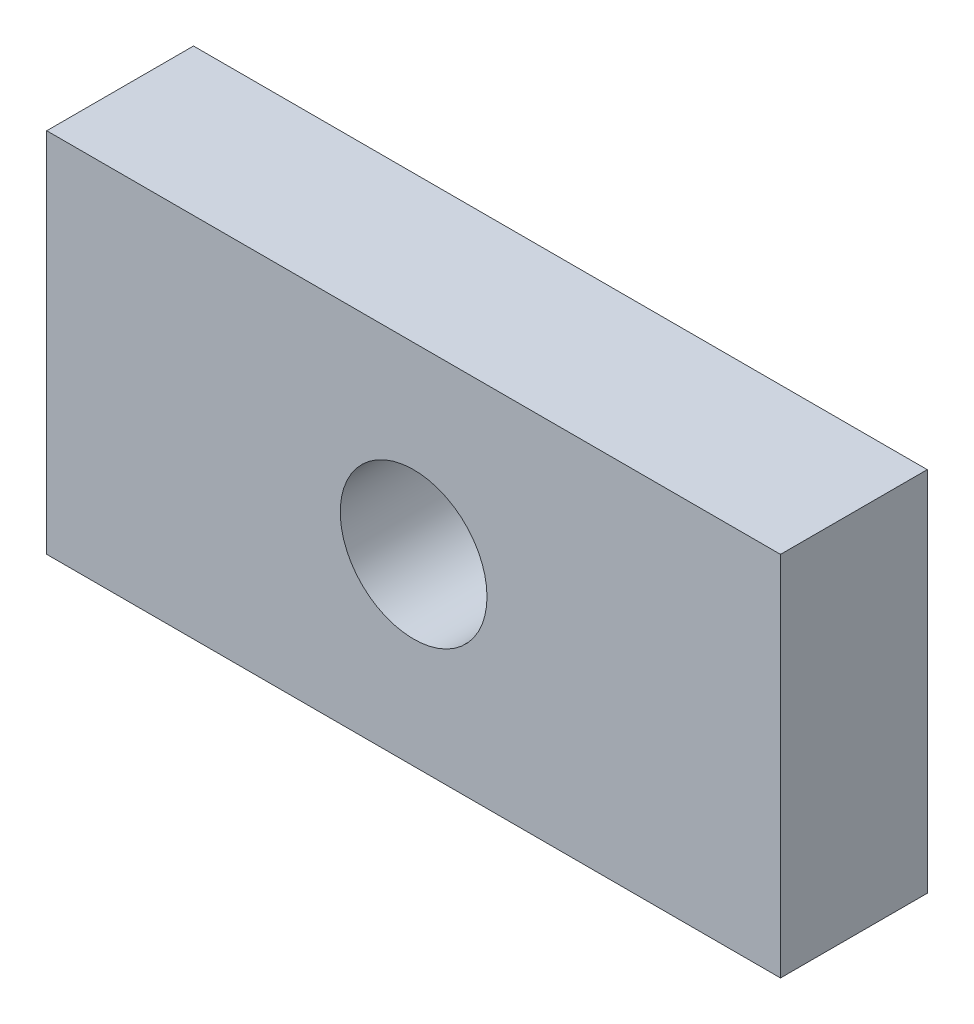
ISO-10303-21;
HEADER;
FILE_DESCRIPTION(('STEP AP214'),'2;1');
FILE_NAME('part.step','',(''),(''),'','','');
FILE_SCHEMA(('AUTOMOTIVE_DESIGN { 1 0 10303 214 1 1 1 1 }'));
ENDSEC;
DATA;
#1=APPLICATION_CONTEXT('core data for automotive mechanical design processes');
#2=APPLICATION_PROTOCOL_DEFINITION('international standard','automotive_design',2000,#1);
#3=PRODUCT_CONTEXT('',#1,'mechanical');
#4=PRODUCT('Part','Part','',(#3));
#5=PRODUCT_RELATED_PRODUCT_CATEGORY('part','',(#4));
#6=PRODUCT_DEFINITION_FORMATION('','',#4);
#7=PRODUCT_DEFINITION_CONTEXT('part definition',#1,'design');
#8=PRODUCT_DEFINITION('design','',#6,#7);
#9=PRODUCT_DEFINITION_SHAPE('','',#8);
#10=(LENGTH_UNIT() NAMED_UNIT(*) SI_UNIT(.MILLI.,.METRE.));
#11=(NAMED_UNIT(*) PLANE_ANGLE_UNIT() SI_UNIT($,.RADIAN.));
#12=(NAMED_UNIT(*) SI_UNIT($,.STERADIAN.) SOLID_ANGLE_UNIT());
#13=UNCERTAINTY_MEASURE_WITH_UNIT(LENGTH_MEASURE(1.E-05),#10,'distance_accuracy_value','');
#14=(GEOMETRIC_REPRESENTATION_CONTEXT(3) GLOBAL_UNCERTAINTY_ASSIGNED_CONTEXT((#13)) GLOBAL_UNIT_ASSIGNED_CONTEXT((#10,
#11,#12)) REPRESENTATION_CONTEXT('',''));
#15=CARTESIAN_POINT('',(0.,0.,0.));
#16=DIRECTION('',(0.,0.,1.));
#17=DIRECTION('',(1.,0.,0.));
#18=AXIS2_PLACEMENT_3D('',#15,#16,#17);
#19=CARTESIAN_POINT('',(50.,-25.,-20.));
#20=DIRECTION('',(1.,0.,0.));
#21=DIRECTION('',(0.,0.,-1.));
#22=AXIS2_PLACEMENT_3D('',#19,#20,#21);
#23=PLANE('',#22);
#24=DIRECTION('',(0.,1.,0.));
#25=VECTOR('',#24,1.);
#26=CARTESIAN_POINT('',(50.,-25.,0.));
#27=LINE('',#26,#25);
#28=CARTESIAN_POINT('',(50.,-25.,0.));
#29=VERTEX_POINT('',#28);
#30=CARTESIAN_POINT('',(50.,25.,0.));
#31=VERTEX_POINT('',#30);
#32=EDGE_CURVE('E102',#29,#31,#27,.T.);
#33=ORIENTED_EDGE('',*,*,#32,.F.);
#34=DIRECTION('',(0.,0.,1.));
#35=VECTOR('',#34,1.);
#36=CARTESIAN_POINT('',(50.,-25.,-20.));
#37=LINE('',#36,#35);
#38=CARTESIAN_POINT('',(50.,-25.,-20.));
#39=VERTEX_POINT('',#38);
#40=EDGE_CURVE('E11',#39,#29,#37,.T.);
#41=ORIENTED_EDGE('',*,*,#40,.F.);
#42=DIRECTION('',(0.,1.,0.));
#43=VECTOR('',#42,1.);
#44=CARTESIAN_POINT('',(50.,-25.,-20.));
#45=LINE('',#44,#43);
#46=CARTESIAN_POINT('',(50.,25.,-20.));
#47=VERTEX_POINT('',#46);
#48=EDGE_CURVE('E100',#39,#47,#45,.T.);
#49=ORIENTED_EDGE('',*,*,#48,.T.);
#50=DIRECTION('',(0.,0.,1.));
#51=VECTOR('',#50,1.);
#52=CARTESIAN_POINT('',(50.,25.,-20.));
#53=LINE('',#52,#51);
#54=EDGE_CURVE('E45',#47,#31,#53,.T.);
#55=ORIENTED_EDGE('',*,*,#54,.T.);
#56=EDGE_LOOP('',(#33,#41,#49,#55));
#57=FACE_BOUND('',#56,.T.);
#58=ADVANCED_FACE('F39',(#57),#23,.T.);
#59=CARTESIAN_POINT('',(-50.,-25.,-20.));
#60=DIRECTION('',(0.,-1.,0.));
#61=DIRECTION('',(0.,0.,-1.));
#62=AXIS2_PLACEMENT_3D('',#59,#60,#61);
#63=PLANE('',#62);
#64=DIRECTION('',(1.,0.,0.));
#65=VECTOR('',#64,1.);
#66=CARTESIAN_POINT('',(-50.,-25.,0.));
#67=LINE('',#66,#65);
#68=CARTESIAN_POINT('',(-50.,-25.,0.));
#69=VERTEX_POINT('',#68);
#70=EDGE_CURVE('E97',#69,#29,#67,.T.);
#71=ORIENTED_EDGE('',*,*,#70,.F.);
#72=DIRECTION('',(0.,0.,1.));
#73=VECTOR('',#72,1.);
#74=CARTESIAN_POINT('',(-50.,-25.,-20.));
#75=LINE('',#74,#73);
#76=CARTESIAN_POINT('',(-50.,-25.,-20.));
#77=VERTEX_POINT('',#76);
#78=EDGE_CURVE('E48',#77,#69,#75,.T.);
#79=ORIENTED_EDGE('',*,*,#78,.F.);
#80=DIRECTION('',(1.,0.,0.));
#81=VECTOR('',#80,1.);
#82=CARTESIAN_POINT('',(-50.,-25.,-20.));
#83=LINE('',#82,#81);
#84=EDGE_CURVE('E94',#77,#39,#83,.T.);
#85=ORIENTED_EDGE('',*,*,#84,.T.);
#86=ORIENTED_EDGE('',*,*,#40,.T.);
#87=EDGE_LOOP('',(#71,#79,#85,#86));
#88=FACE_BOUND('',#87,.T.);
#89=ADVANCED_FACE('F113',(#88),#63,.T.);
#90=CARTESIAN_POINT('',(-50.,-25.,-20.));
#91=DIRECTION('',(-1.,0.,0.));
#92=DIRECTION('',(0.,0.,1.));
#93=AXIS2_PLACEMENT_3D('',#90,#91,#92);
#94=PLANE('',#93);
#95=DIRECTION('',(0.,-1.,0.));
#96=VECTOR('',#95,1.);
#97=CARTESIAN_POINT('',(-50.,-25.,0.));
#98=LINE('',#97,#96);
#99=CARTESIAN_POINT('',(-50.,25.,0.));
#100=VERTEX_POINT('',#99);
#101=EDGE_CURVE('E90',#100,#69,#98,.T.);
#102=ORIENTED_EDGE('',*,*,#101,.F.);
#103=DIRECTION('',(0.,0.,1.));
#104=VECTOR('',#103,1.);
#105=CARTESIAN_POINT('',(-50.,25.,-20.));
#106=LINE('',#105,#104);
#107=CARTESIAN_POINT('',(-50.,25.,-20.));
#108=VERTEX_POINT('',#107);
#109=EDGE_CURVE('E82',#108,#100,#106,.T.);
#110=ORIENTED_EDGE('',*,*,#109,.F.);
#111=DIRECTION('',(0.,-1.,0.));
#112=VECTOR('',#111,1.);
#113=CARTESIAN_POINT('',(-50.,-25.,-20.));
#114=LINE('',#113,#112);
#115=EDGE_CURVE('E87',#108,#77,#114,.T.);
#116=ORIENTED_EDGE('',*,*,#115,.T.);
#117=ORIENTED_EDGE('',*,*,#78,.T.);
#118=EDGE_LOOP('',(#102,#110,#116,#117));
#119=FACE_BOUND('',#118,.T.);
#120=ADVANCED_FACE('F88',(#119),#94,.T.);
#121=CARTESIAN_POINT('',(-50.,25.,-20.));
#122=DIRECTION('',(0.,1.,0.));
#123=DIRECTION('',(0.,0.,1.));
#124=AXIS2_PLACEMENT_3D('',#121,#122,#123);
#125=PLANE('',#124);
#126=DIRECTION('',(-1.,0.,0.));
#127=VECTOR('',#126,1.);
#128=CARTESIAN_POINT('',(-50.,25.,0.));
#129=LINE('',#128,#127);
#130=EDGE_CURVE('E110',#31,#100,#129,.T.);
#131=ORIENTED_EDGE('',*,*,#130,.F.);
#132=ORIENTED_EDGE('',*,*,#54,.F.);
#133=DIRECTION('',(-1.,0.,0.));
#134=VECTOR('',#133,1.);
#135=CARTESIAN_POINT('',(-50.,25.,-20.));
#136=LINE('',#135,#134);
#137=EDGE_CURVE('E91',#47,#108,#136,.T.);
#138=ORIENTED_EDGE('',*,*,#137,.T.);
#139=ORIENTED_EDGE('',*,*,#109,.T.);
#140=EDGE_LOOP('',(#131,#132,#138,#139));
#141=FACE_BOUND('',#140,.T.);
#142=ADVANCED_FACE('F96',(#141),#125,.T.);
#143=CARTESIAN_POINT('',(0.,0.,-20.));
#144=DIRECTION('',(0.,0.,-1.));
#145=DIRECTION('',(-1.,0.,0.));
#146=AXIS2_PLACEMENT_3D('',#143,#144,#145);
#147=PLANE('',#146);
#148=CARTESIAN_POINT('',(0.,0.,-20.));
#149=DIRECTION('',(0.,0.,1.));
#150=DIRECTION('',(1.,0.,0.));
#151=AXIS2_PLACEMENT_3D('',#148,#149,#150);
#152=CIRCLE('',#151,10.);
#153=CARTESIAN_POINT('',(10.,0.,-20.));
#154=VERTEX_POINT('',#153);
#155=EDGE_CURVE('E107',#154,#154,#152,.T.);
#156=ORIENTED_EDGE('',*,*,#155,.T.);
#157=EDGE_LOOP('',(#156));
#158=FACE_BOUND('',#157,.T.);
#159=ORIENTED_EDGE('',*,*,#48,.F.);
#160=ORIENTED_EDGE('',*,*,#84,.F.);
#161=ORIENTED_EDGE('',*,*,#115,.F.);
#162=ORIENTED_EDGE('',*,*,#137,.F.);
#163=EDGE_LOOP('',(#159,#160,#161,#162));
#164=FACE_BOUND('',#163,.T.);
#165=ADVANCED_FACE('F95',(#158,#164),#147,.T.);
#166=CARTESIAN_POINT('',(0.,0.,0.));
#167=DIRECTION('',(0.,0.,-1.));
#168=DIRECTION('',(-1.,0.,0.));
#169=AXIS2_PLACEMENT_3D('',#166,#167,#168);
#170=PLANE('',#169);
#171=CARTESIAN_POINT('',(0.,0.,0.));
#172=DIRECTION('',(0.,0.,1.));
#173=DIRECTION('',(1.,0.,0.));
#174=AXIS2_PLACEMENT_3D('',#171,#172,#173);
#175=CIRCLE('',#174,10.);
#176=CARTESIAN_POINT('',(10.,0.,0.));
#177=VERTEX_POINT('',#176);
#178=EDGE_CURVE('E144',#177,#177,#175,.T.);
#179=ORIENTED_EDGE('',*,*,#178,.F.);
#180=EDGE_LOOP('',(#179));
#181=FACE_BOUND('',#180,.T.);
#182=ORIENTED_EDGE('',*,*,#32,.T.);
#183=ORIENTED_EDGE('',*,*,#130,.T.);
#184=ORIENTED_EDGE('',*,*,#101,.T.);
#185=ORIENTED_EDGE('',*,*,#70,.T.);
#186=EDGE_LOOP('',(#182,#183,#184,#185));
#187=FACE_BOUND('',#186,.T.);
#188=ADVANCED_FACE('F111',(#181,#187),#170,.F.);
#189=CARTESIAN_POINT('',(0.,0.,-20.));
#190=DIRECTION('',(0.,0.,1.));
#191=DIRECTION('',(1.,0.,0.));
#192=AXIS2_PLACEMENT_3D('',#189,#190,#191);
#193=CYLINDRICAL_SURFACE('',#192,10.);
#194=ORIENTED_EDGE('',*,*,#155,.F.);
#195=EDGE_LOOP('',(#194));
#196=FACE_BOUND('',#195,.T.);
#197=ORIENTED_EDGE('',*,*,#178,.T.);
#198=EDGE_LOOP('',(#197));
#199=FACE_BOUND('',#198,.T.);
#200=ADVANCED_FACE('F132',(#196,#199),#193,.F.);
#201=CLOSED_SHELL('',(#58,#89,#120,#142,#165,#188,#200));
#202=MANIFOLD_SOLID_BREP('B2',#201);
#203=ADVANCED_BREP_SHAPE_REPRESENTATION('',(#18,#202),#14);
#204=SHAPE_DEFINITION_REPRESENTATION(#9,#203);
ENDSEC;
END-ISO-10303-21;
